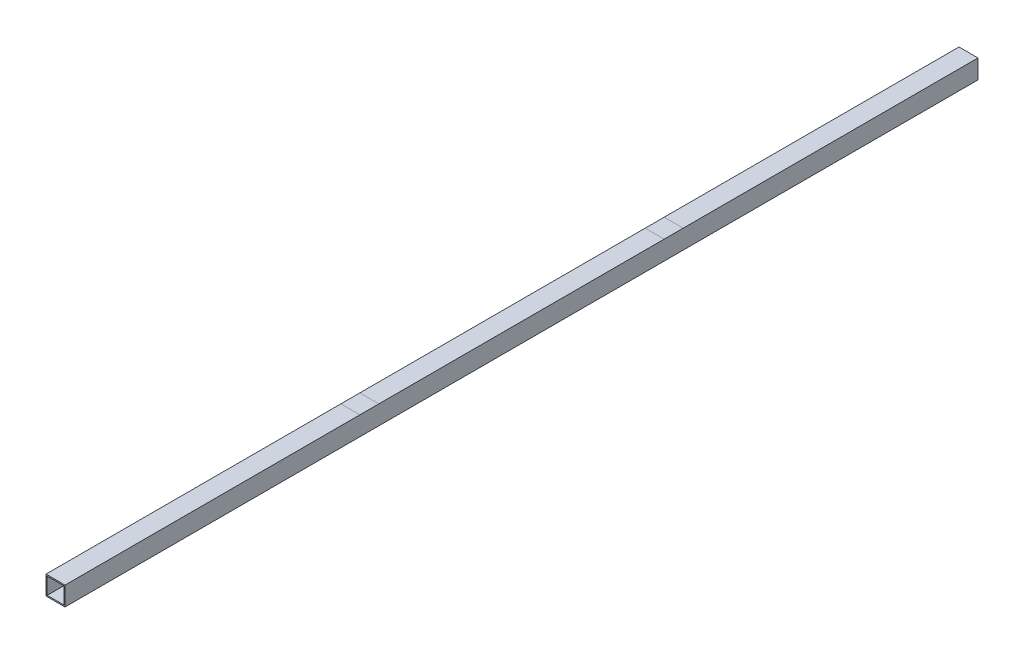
ISO-10303-21;
HEADER;
FILE_DESCRIPTION(('STEP AP214'),'2;1');
FILE_NAME('part.step','',(''),(''),'','','');
FILE_SCHEMA(('AUTOMOTIVE_DESIGN { 1 0 10303 214 1 1 1 1 }'));
ENDSEC;
DATA;
#1=APPLICATION_CONTEXT('core data for automotive mechanical design processes');
#2=APPLICATION_PROTOCOL_DEFINITION('international standard','automotive_design',2000,#1);
#3=PRODUCT_CONTEXT('',#1,'mechanical');
#4=PRODUCT('Part','Part','',(#3));
#5=PRODUCT_RELATED_PRODUCT_CATEGORY('part','',(#4));
#6=PRODUCT_DEFINITION_FORMATION('','',#4);
#7=PRODUCT_DEFINITION_CONTEXT('part definition',#1,'design');
#8=PRODUCT_DEFINITION('design','',#6,#7);
#9=PRODUCT_DEFINITION_SHAPE('','',#8);
#10=(LENGTH_UNIT() NAMED_UNIT(*) SI_UNIT(.MILLI.,.METRE.));
#11=(NAMED_UNIT(*) PLANE_ANGLE_UNIT() SI_UNIT($,.RADIAN.));
#12=(NAMED_UNIT(*) SI_UNIT($,.STERADIAN.) SOLID_ANGLE_UNIT());
#13=UNCERTAINTY_MEASURE_WITH_UNIT(LENGTH_MEASURE(1.E-05),#10,'distance_accuracy_value','');
#14=(GEOMETRIC_REPRESENTATION_CONTEXT(3) GLOBAL_UNCERTAINTY_ASSIGNED_CONTEXT((#13)) GLOBAL_UNIT_ASSIGNED_CONTEXT((#10,
#11,#12)) REPRESENTATION_CONTEXT('',''));
#15=CARTESIAN_POINT('',(0.,0.,0.));
#16=DIRECTION('',(0.,0.,1.));
#17=DIRECTION('',(1.,0.,0.));
#18=AXIS2_PLACEMENT_3D('',#15,#16,#17);
#19=CARTESIAN_POINT('',(-40.,40.,3840.));
#20=DIRECTION('',(0.,-1.,0.));
#21=DIRECTION('',(0.,0.,-1.));
#22=AXIS2_PLACEMENT_3D('',#19,#20,#21);
#23=PLANE('',#22);
#24=DIRECTION('',(1.,0.,0.));
#25=VECTOR('',#24,1.);
#26=CARTESIAN_POINT('',(-40.,40.,1320.));
#27=LINE('',#26,#25);
#28=CARTESIAN_POINT('',(-40.,40.,1320.));
#29=VERTEX_POINT('',#28);
#30=CARTESIAN_POINT('',(40.,40.,1320.));
#31=VERTEX_POINT('',#30);
#32=EDGE_CURVE('E11',#29,#31,#27,.T.);
#33=ORIENTED_EDGE('',*,*,#32,.F.);
#34=DIRECTION('',(0.,0.,-1.));
#35=VECTOR('',#34,1.);
#36=CARTESIAN_POINT('',(-40.,40.,3840.));
#37=LINE('',#36,#35);
#38=CARTESIAN_POINT('',(-40.,40.,2520.));
#39=VERTEX_POINT('',#38);
#40=EDGE_CURVE('E257',#39,#29,#37,.T.);
#41=ORIENTED_EDGE('',*,*,#40,.F.);
#42=DIRECTION('',(-1.,0.,0.));
#43=VECTOR('',#42,1.);
#44=CARTESIAN_POINT('',(-40.,40.,2520.));
#45=LINE('',#44,#43);
#46=CARTESIAN_POINT('',(40.,40.,2520.));
#47=VERTEX_POINT('',#46);
#48=EDGE_CURVE('E209',#47,#39,#45,.T.);
#49=ORIENTED_EDGE('',*,*,#48,.F.);
#50=DIRECTION('',(0.,0.,-1.));
#51=VECTOR('',#50,1.);
#52=CARTESIAN_POINT('',(40.,40.,3840.));
#53=LINE('',#52,#51);
#54=EDGE_CURVE('E238',#47,#31,#53,.T.);
#55=ORIENTED_EDGE('',*,*,#54,.T.);
#56=EDGE_LOOP('',(#33,#41,#49,#55));
#57=FACE_BOUND('',#56,.T.);
#58=ADVANCED_FACE('F43',(#57),#23,.F.);
#59=DIRECTION('',(-1.,0.,0.));
#60=VECTOR('',#59,1.);
#61=CARTESIAN_POINT('',(-40.,40.,1240.));
#62=LINE('',#61,#60);
#63=CARTESIAN_POINT('',(40.,40.,1240.));
#64=VERTEX_POINT('',#63);
#65=CARTESIAN_POINT('',(-40.,40.,1240.));
#66=VERTEX_POINT('',#65);
#67=EDGE_CURVE('E52',#64,#66,#62,.T.);
#68=ORIENTED_EDGE('',*,*,#67,.F.);
#69=CARTESIAN_POINT('',(40.,40.,0.));
#70=VERTEX_POINT('',#69);
#71=EDGE_CURVE('E197',#64,#70,#53,.T.);
#72=ORIENTED_EDGE('',*,*,#71,.T.);
#73=DIRECTION('',(-1.,0.,0.));
#74=VECTOR('',#73,1.);
#75=CARTESIAN_POINT('',(-40.,40.,0.));
#76=LINE('',#75,#74);
#77=CARTESIAN_POINT('',(-40.,40.,0.));
#78=VERTEX_POINT('',#77);
#79=EDGE_CURVE('E178',#70,#78,#76,.T.);
#80=ORIENTED_EDGE('',*,*,#79,.T.);
#81=EDGE_CURVE('E184',#66,#78,#37,.T.);
#82=ORIENTED_EDGE('',*,*,#81,.F.);
#83=EDGE_LOOP('',(#68,#72,#80,#82));
#84=FACE_BOUND('',#83,.T.);
#85=ADVANCED_FACE('F253',(#84),#23,.F.);
#86=DIRECTION('',(1.,0.,0.));
#87=VECTOR('',#86,1.);
#88=CARTESIAN_POINT('',(-40.,40.,2600.));
#89=LINE('',#88,#87);
#90=CARTESIAN_POINT('',(-40.,40.,2600.));
#91=VERTEX_POINT('',#90);
#92=CARTESIAN_POINT('',(40.,40.,2600.));
#93=VERTEX_POINT('',#92);
#94=EDGE_CURVE('E212',#91,#93,#89,.T.);
#95=ORIENTED_EDGE('',*,*,#94,.F.);
#96=CARTESIAN_POINT('',(-40.,40.,3840.));
#97=VERTEX_POINT('',#96);
#98=EDGE_CURVE('E194',#97,#91,#37,.T.);
#99=ORIENTED_EDGE('',*,*,#98,.F.);
#100=DIRECTION('',(-1.,0.,0.));
#101=VECTOR('',#100,1.);
#102=CARTESIAN_POINT('',(-40.,40.,3840.));
#103=LINE('',#102,#101);
#104=CARTESIAN_POINT('',(40.,40.,3840.));
#105=VERTEX_POINT('',#104);
#106=EDGE_CURVE('E182',#105,#97,#103,.T.);
#107=ORIENTED_EDGE('',*,*,#106,.F.);
#108=EDGE_CURVE('E199',#105,#93,#53,.T.);
#109=ORIENTED_EDGE('',*,*,#108,.T.);
#110=EDGE_LOOP('',(#95,#99,#107,#109));
#111=FACE_BOUND('',#110,.T.);
#112=ADVANCED_FACE('F239',(#111),#23,.F.);
#113=EDGE_CURVE('E259',#29,#66,#37,.T.);
#114=ORIENTED_EDGE('',*,*,#113,.F.);
#115=ORIENTED_EDGE('',*,*,#32,.T.);
#116=EDGE_CURVE('E255',#31,#64,#53,.T.);
#117=ORIENTED_EDGE('',*,*,#116,.T.);
#118=ORIENTED_EDGE('',*,*,#67,.T.);
#119=EDGE_LOOP('',(#114,#115,#117,#118));
#120=FACE_BOUND('',#119,.T.);
#121=ADVANCED_FACE('F277',(#120),#23,.F.);
#122=CARTESIAN_POINT('',(-40.,-40.,3840.));
#123=DIRECTION('',(0.,0.,1.));
#124=DIRECTION('',(1.,0.,0.));
#125=AXIS2_PLACEMENT_3D('',#122,#123,#124);
#126=PLANE('',#125);
#127=DIRECTION('',(0.,-1.,0.));
#128=VECTOR('',#127,1.);
#129=CARTESIAN_POINT('',(-40.,40.,3840.));
#130=LINE('',#129,#128);
#131=CARTESIAN_POINT('',(-40.,-40.,3840.));
#132=VERTEX_POINT('',#131);
#133=EDGE_CURVE('E174',#97,#132,#130,.T.);
#134=ORIENTED_EDGE('',*,*,#133,.T.);
#135=DIRECTION('',(1.,0.,0.));
#136=VECTOR('',#135,1.);
#137=CARTESIAN_POINT('',(-40.,-40.,3840.));
#138=LINE('',#137,#136);
#139=CARTESIAN_POINT('',(40.,-40.,3840.));
#140=VERTEX_POINT('',#139);
#141=EDGE_CURVE('E177',#132,#140,#138,.T.);
#142=ORIENTED_EDGE('',*,*,#141,.T.);
#143=DIRECTION('',(0.,1.,0.));
#144=VECTOR('',#143,1.);
#145=CARTESIAN_POINT('',(40.,40.,3840.));
#146=LINE('',#145,#144);
#147=EDGE_CURVE('E180',#140,#105,#146,.T.);
#148=ORIENTED_EDGE('',*,*,#147,.T.);
#149=ORIENTED_EDGE('',*,*,#106,.T.);
#150=EDGE_LOOP('',(#134,#142,#148,#149));
#151=FACE_BOUND('',#150,.T.);
#152=DIRECTION('',(1.,0.,0.));
#153=VECTOR('',#152,1.);
#154=CARTESIAN_POINT('',(-35.,-35.,3840.));
#155=LINE('',#154,#153);
#156=CARTESIAN_POINT('',(-35.,-35.,3840.));
#157=VERTEX_POINT('',#156);
#158=CARTESIAN_POINT('',(35.,-35.,3840.));
#159=VERTEX_POINT('',#158);
#160=EDGE_CURVE('E142',#157,#159,#155,.T.);
#161=ORIENTED_EDGE('',*,*,#160,.F.);
#162=DIRECTION('',(0.,-1.,0.));
#163=VECTOR('',#162,1.);
#164=CARTESIAN_POINT('',(-35.,35.,3840.));
#165=LINE('',#164,#163);
#166=CARTESIAN_POINT('',(-35.,35.,3840.));
#167=VERTEX_POINT('',#166);
#168=EDGE_CURVE('E132',#167,#157,#165,.T.);
#169=ORIENTED_EDGE('',*,*,#168,.F.);
#170=DIRECTION('',(-1.,0.,0.));
#171=VECTOR('',#170,1.);
#172=CARTESIAN_POINT('',(-35.,35.,3840.));
#173=LINE('',#172,#171);
#174=CARTESIAN_POINT('',(35.,35.,3840.));
#175=VERTEX_POINT('',#174);
#176=EDGE_CURVE('E158',#175,#167,#173,.T.);
#177=ORIENTED_EDGE('',*,*,#176,.F.);
#178=DIRECTION('',(0.,1.,0.));
#179=VECTOR('',#178,1.);
#180=CARTESIAN_POINT('',(35.,35.,3840.));
#181=LINE('',#180,#179);
#182=EDGE_CURVE('E156',#159,#175,#181,.T.);
#183=ORIENTED_EDGE('',*,*,#182,.F.);
#184=EDGE_LOOP('',(#161,#169,#177,#183));
#185=FACE_BOUND('',#184,.T.);
#186=ADVANCED_FACE('F154',(#151,#185),#126,.T.);
#187=CARTESIAN_POINT('',(-40.,-40.,0.));
#188=DIRECTION('',(0.,0.,1.));
#189=DIRECTION('',(1.,0.,0.));
#190=AXIS2_PLACEMENT_3D('',#187,#188,#189);
#191=PLANE('',#190);
#192=DIRECTION('',(0.,-1.,0.));
#193=VECTOR('',#192,1.);
#194=CARTESIAN_POINT('',(-40.,40.,0.));
#195=LINE('',#194,#193);
#196=CARTESIAN_POINT('',(-40.,-40.,0.));
#197=VERTEX_POINT('',#196);
#198=EDGE_CURVE('E150',#78,#197,#195,.T.);
#199=ORIENTED_EDGE('',*,*,#198,.F.);
#200=ORIENTED_EDGE('',*,*,#79,.F.);
#201=DIRECTION('',(0.,1.,0.));
#202=VECTOR('',#201,1.);
#203=CARTESIAN_POINT('',(40.,40.,0.));
#204=LINE('',#203,#202);
#205=CARTESIAN_POINT('',(40.,-40.,0.));
#206=VERTEX_POINT('',#205);
#207=EDGE_CURVE('E189',#206,#70,#204,.T.);
#208=ORIENTED_EDGE('',*,*,#207,.F.);
#209=DIRECTION('',(1.,0.,0.));
#210=VECTOR('',#209,1.);
#211=CARTESIAN_POINT('',(-40.,-40.,0.));
#212=LINE('',#211,#210);
#213=EDGE_CURVE('E187',#197,#206,#212,.T.);
#214=ORIENTED_EDGE('',*,*,#213,.F.);
#215=EDGE_LOOP('',(#199,#200,#208,#214));
#216=FACE_BOUND('',#215,.T.);
#217=DIRECTION('',(0.,-1.,0.));
#218=VECTOR('',#217,1.);
#219=CARTESIAN_POINT('',(-35.,35.,0.));
#220=LINE('',#219,#218);
#221=CARTESIAN_POINT('',(-35.,35.,0.));
#222=VERTEX_POINT('',#221);
#223=CARTESIAN_POINT('',(-35.,-35.,0.));
#224=VERTEX_POINT('',#223);
#225=EDGE_CURVE('E162',#222,#224,#220,.T.);
#226=ORIENTED_EDGE('',*,*,#225,.T.);
#227=DIRECTION('',(1.,0.,0.));
#228=VECTOR('',#227,1.);
#229=CARTESIAN_POINT('',(-35.,-35.,0.));
#230=LINE('',#229,#228);
#231=CARTESIAN_POINT('',(35.,-35.,0.));
#232=VERTEX_POINT('',#231);
#233=EDGE_CURVE('E149',#224,#232,#230,.T.);
#234=ORIENTED_EDGE('',*,*,#233,.T.);
#235=DIRECTION('',(0.,1.,0.));
#236=VECTOR('',#235,1.);
#237=CARTESIAN_POINT('',(35.,35.,0.));
#238=LINE('',#237,#236);
#239=CARTESIAN_POINT('',(35.,35.,0.));
#240=VERTEX_POINT('',#239);
#241=EDGE_CURVE('E165',#232,#240,#238,.T.);
#242=ORIENTED_EDGE('',*,*,#241,.T.);
#243=DIRECTION('',(-1.,0.,0.));
#244=VECTOR('',#243,1.);
#245=CARTESIAN_POINT('',(-35.,35.,0.));
#246=LINE('',#245,#244);
#247=EDGE_CURVE('E143',#240,#222,#246,.T.);
#248=ORIENTED_EDGE('',*,*,#247,.T.);
#249=EDGE_LOOP('',(#226,#234,#242,#248));
#250=FACE_BOUND('',#249,.T.);
#251=ADVANCED_FACE('F250',(#216,#250),#191,.F.);
#252=CARTESIAN_POINT('',(-40.,40.,3840.));
#253=DIRECTION('',(1.,0.,0.));
#254=DIRECTION('',(0.,0.,-1.));
#255=AXIS2_PLACEMENT_3D('',#252,#253,#254);
#256=PLANE('',#255);
#257=ORIENTED_EDGE('',*,*,#198,.T.);
#258=DIRECTION('',(0.,0.,-1.));
#259=VECTOR('',#258,1.);
#260=CARTESIAN_POINT('',(-40.,-40.,3840.));
#261=LINE('',#260,#259);
#262=EDGE_CURVE('E206',#132,#197,#261,.T.);
#263=ORIENTED_EDGE('',*,*,#262,.F.);
#264=ORIENTED_EDGE('',*,*,#133,.F.);
#265=ORIENTED_EDGE('',*,*,#98,.T.);
#266=EDGE_CURVE('E198',#91,#39,#37,.T.);
#267=ORIENTED_EDGE('',*,*,#266,.T.);
#268=ORIENTED_EDGE('',*,*,#40,.T.);
#269=ORIENTED_EDGE('',*,*,#113,.T.);
#270=ORIENTED_EDGE('',*,*,#81,.T.);
#271=EDGE_LOOP('',(#257,#263,#264,#265,#267,#268,#269,#270));
#272=FACE_BOUND('',#271,.T.);
#273=ADVANCED_FACE('F45',(#272),#256,.F.);
#274=CARTESIAN_POINT('',(-40.,-40.,3840.));
#275=DIRECTION('',(0.,1.,0.));
#276=DIRECTION('',(-1.,0.,0.));
#277=AXIS2_PLACEMENT_3D('',#274,#275,#276);
#278=PLANE('',#277);
#279=ORIENTED_EDGE('',*,*,#213,.T.);
#280=DIRECTION('',(0.,0.,-1.));
#281=VECTOR('',#280,1.);
#282=CARTESIAN_POINT('',(40.,-40.,3840.));
#283=LINE('',#282,#281);
#284=EDGE_CURVE('E202',#140,#206,#283,.T.);
#285=ORIENTED_EDGE('',*,*,#284,.F.);
#286=ORIENTED_EDGE('',*,*,#141,.F.);
#287=ORIENTED_EDGE('',*,*,#262,.T.);
#288=EDGE_LOOP('',(#279,#285,#286,#287));
#289=FACE_BOUND('',#288,.T.);
#290=ADVANCED_FACE('F260',(#289),#278,.F.);
#291=CARTESIAN_POINT('',(40.,40.,3840.));
#292=DIRECTION('',(-1.,0.,0.));
#293=DIRECTION('',(0.,-1.,0.));
#294=AXIS2_PLACEMENT_3D('',#291,#292,#293);
#295=PLANE('',#294);
#296=ORIENTED_EDGE('',*,*,#207,.T.);
#297=ORIENTED_EDGE('',*,*,#71,.F.);
#298=ORIENTED_EDGE('',*,*,#116,.F.);
#299=ORIENTED_EDGE('',*,*,#54,.F.);
#300=EDGE_CURVE('E203',#93,#47,#53,.T.);
#301=ORIENTED_EDGE('',*,*,#300,.F.);
#302=ORIENTED_EDGE('',*,*,#108,.F.);
#303=ORIENTED_EDGE('',*,*,#147,.F.);
#304=ORIENTED_EDGE('',*,*,#284,.T.);
#305=EDGE_LOOP('',(#296,#297,#298,#299,#301,#302,#303,#304));
#306=FACE_BOUND('',#305,.T.);
#307=ADVANCED_FACE('F234',(#306),#295,.F.);
#308=ORIENTED_EDGE('',*,*,#266,.F.);
#309=ORIENTED_EDGE('',*,*,#94,.T.);
#310=ORIENTED_EDGE('',*,*,#300,.T.);
#311=ORIENTED_EDGE('',*,*,#48,.T.);
#312=EDGE_LOOP('',(#308,#309,#310,#311));
#313=FACE_BOUND('',#312,.T.);
#314=ADVANCED_FACE('F227',(#313),#23,.F.);
#315=CARTESIAN_POINT('',(-35.,35.,3840.));
#316=DIRECTION('',(1.,0.,0.));
#317=DIRECTION('',(0.,1.,0.));
#318=AXIS2_PLACEMENT_3D('',#315,#316,#317);
#319=PLANE('',#318);
#320=ORIENTED_EDGE('',*,*,#225,.F.);
#321=DIRECTION('',(0.,0.,-1.));
#322=VECTOR('',#321,1.);
#323=CARTESIAN_POINT('',(-35.,35.,3840.));
#324=LINE('',#323,#322);
#325=EDGE_CURVE('E138',#167,#222,#324,.T.);
#326=ORIENTED_EDGE('',*,*,#325,.F.);
#327=ORIENTED_EDGE('',*,*,#168,.T.);
#328=DIRECTION('',(0.,0.,-1.));
#329=VECTOR('',#328,1.);
#330=CARTESIAN_POINT('',(-35.,-35.,3840.));
#331=LINE('',#330,#329);
#332=EDGE_CURVE('E135',#157,#224,#331,.T.);
#333=ORIENTED_EDGE('',*,*,#332,.T.);
#334=EDGE_LOOP('',(#320,#326,#327,#333));
#335=FACE_BOUND('',#334,.T.);
#336=ADVANCED_FACE('F134',(#335),#319,.T.);
#337=CARTESIAN_POINT('',(-35.,-35.,3840.));
#338=DIRECTION('',(0.,1.,0.));
#339=DIRECTION('',(0.,0.,1.));
#340=AXIS2_PLACEMENT_3D('',#337,#338,#339);
#341=PLANE('',#340);
#342=ORIENTED_EDGE('',*,*,#233,.F.);
#343=ORIENTED_EDGE('',*,*,#332,.F.);
#344=ORIENTED_EDGE('',*,*,#160,.T.);
#345=DIRECTION('',(0.,0.,-1.));
#346=VECTOR('',#345,1.);
#347=CARTESIAN_POINT('',(35.,-35.,3840.));
#348=LINE('',#347,#346);
#349=EDGE_CURVE('E151',#159,#232,#348,.T.);
#350=ORIENTED_EDGE('',*,*,#349,.T.);
#351=EDGE_LOOP('',(#342,#343,#344,#350));
#352=FACE_BOUND('',#351,.T.);
#353=ADVANCED_FACE('F146',(#352),#341,.T.);
#354=CARTESIAN_POINT('',(35.,35.,3840.));
#355=DIRECTION('',(-1.,0.,0.));
#356=DIRECTION('',(0.,-1.,0.));
#357=AXIS2_PLACEMENT_3D('',#354,#355,#356);
#358=PLANE('',#357);
#359=ORIENTED_EDGE('',*,*,#241,.F.);
#360=ORIENTED_EDGE('',*,*,#349,.F.);
#361=ORIENTED_EDGE('',*,*,#182,.T.);
#362=DIRECTION('',(0.,0.,-1.));
#363=VECTOR('',#362,1.);
#364=CARTESIAN_POINT('',(35.,35.,3840.));
#365=LINE('',#364,#363);
#366=EDGE_CURVE('E171',#175,#240,#365,.T.);
#367=ORIENTED_EDGE('',*,*,#366,.T.);
#368=EDGE_LOOP('',(#359,#360,#361,#367));
#369=FACE_BOUND('',#368,.T.);
#370=ADVANCED_FACE('F343',(#369),#358,.T.);
#371=CARTESIAN_POINT('',(-35.,35.,3840.));
#372=DIRECTION('',(0.,-1.,0.));
#373=DIRECTION('',(0.,0.,-1.));
#374=AXIS2_PLACEMENT_3D('',#371,#372,#373);
#375=PLANE('',#374);
#376=ORIENTED_EDGE('',*,*,#247,.F.);
#377=ORIENTED_EDGE('',*,*,#366,.F.);
#378=ORIENTED_EDGE('',*,*,#176,.T.);
#379=ORIENTED_EDGE('',*,*,#325,.T.);
#380=EDGE_LOOP('',(#376,#377,#378,#379));
#381=FACE_BOUND('',#380,.T.);
#382=ADVANCED_FACE('F294',(#381),#375,.T.);
#383=CLOSED_SHELL('',(#58,#85,#112,#121,#186,#251,#273,#290,#307,#314,#336,#353,#370,#382));
#384=MANIFOLD_SOLID_BREP('B2',#383);
#385=ADVANCED_BREP_SHAPE_REPRESENTATION('',(#18,#384),#14);
#386=SHAPE_DEFINITION_REPRESENTATION(#9,#385);
ENDSEC;
END-ISO-10303-21;
